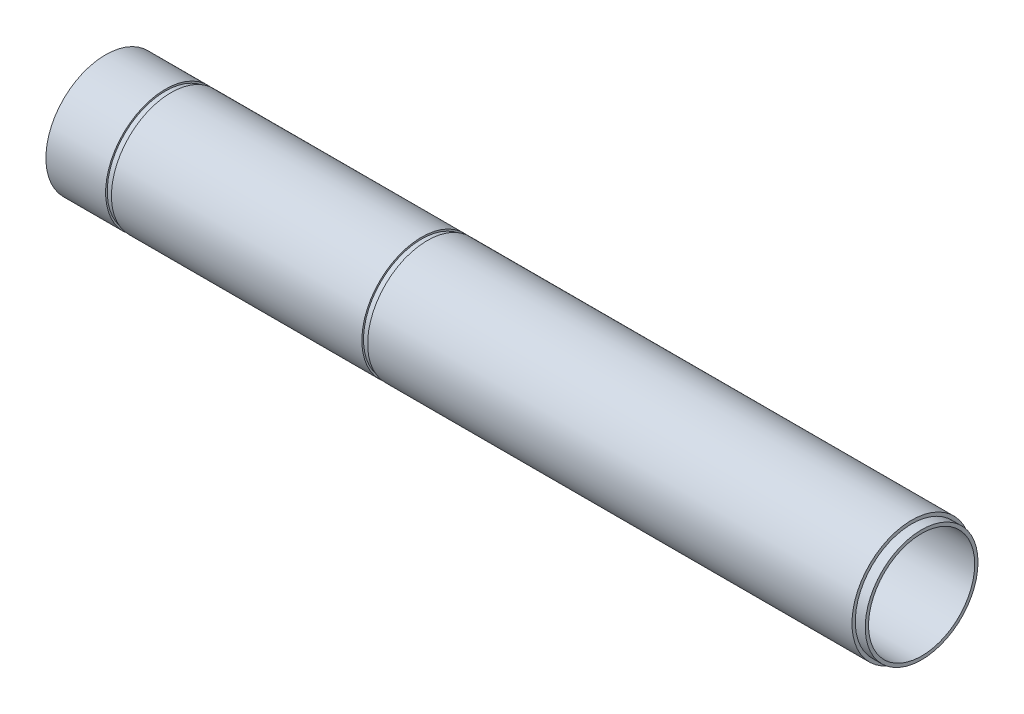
ISO-10303-21;
HEADER;
FILE_DESCRIPTION(('STEP AP214'),'2;1');
FILE_NAME('part.step','',(''),(''),'','','');
FILE_SCHEMA(('AUTOMOTIVE_DESIGN { 1 0 10303 214 1 1 1 1 }'));
ENDSEC;
DATA;
#1=APPLICATION_CONTEXT('core data for automotive mechanical design processes');
#2=APPLICATION_PROTOCOL_DEFINITION('international standard','automotive_design',2000,#1);
#3=PRODUCT_CONTEXT('',#1,'mechanical');
#4=PRODUCT('Part','Part','',(#3));
#5=PRODUCT_RELATED_PRODUCT_CATEGORY('part','',(#4));
#6=PRODUCT_DEFINITION_FORMATION('','',#4);
#7=PRODUCT_DEFINITION_CONTEXT('part definition',#1,'design');
#8=PRODUCT_DEFINITION('design','',#6,#7);
#9=PRODUCT_DEFINITION_SHAPE('','',#8);
#10=(LENGTH_UNIT() NAMED_UNIT(*) SI_UNIT(.MILLI.,.METRE.));
#11=(NAMED_UNIT(*) PLANE_ANGLE_UNIT() SI_UNIT($,.RADIAN.));
#12=(NAMED_UNIT(*) SI_UNIT($,.STERADIAN.) SOLID_ANGLE_UNIT());
#13=UNCERTAINTY_MEASURE_WITH_UNIT(LENGTH_MEASURE(1.E-05),#10,'distance_accuracy_value','');
#14=(GEOMETRIC_REPRESENTATION_CONTEXT(3) GLOBAL_UNCERTAINTY_ASSIGNED_CONTEXT((#13)) GLOBAL_UNIT_ASSIGNED_CONTEXT((#10,
#11,#12)) REPRESENTATION_CONTEXT('',''));
#15=CARTESIAN_POINT('',(0.,0.,0.));
#16=DIRECTION('',(0.,0.,1.));
#17=DIRECTION('',(1.,0.,0.));
#18=AXIS2_PLACEMENT_3D('',#15,#16,#17);
#19=CARTESIAN_POINT('',(48.8143571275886,17.75,0.));
#20=DIRECTION('',(1.,0.,0.));
#21=DIRECTION('',(0.,0.,-1.));
#22=AXIS2_PLACEMENT_3D('',#19,#20,#21);
#23=PLANE('',#22);
#24=CARTESIAN_POINT('',(48.8143571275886,0.,0.));
#25=DIRECTION('',(1.,0.,0.));
#26=DIRECTION('',(0.,0.,-1.));
#27=AXIS2_PLACEMENT_3D('',#24,#25,#26);
#28=CIRCLE('',#27,18.);
#29=CARTESIAN_POINT('',(48.8143571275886,0.,-18.));
#30=VERTEX_POINT('',#29);
#31=EDGE_CURVE('E18',#30,#30,#28,.F.);
#32=ORIENTED_EDGE('',*,*,#31,.F.);
#33=EDGE_LOOP('',(#32));
#34=FACE_BOUND('',#33,.T.);
#35=CARTESIAN_POINT('',(48.8143571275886,0.,0.));
#36=DIRECTION('',(1.,0.,0.));
#37=DIRECTION('',(0.,0.,-1.));
#38=AXIS2_PLACEMENT_3D('',#35,#36,#37);
#39=CIRCLE('',#38,17.5);
#40=CARTESIAN_POINT('',(48.8143571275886,0.,-17.5));
#41=VERTEX_POINT('',#40);
#42=EDGE_CURVE('E58',#41,#41,#39,.T.);
#43=ORIENTED_EDGE('',*,*,#42,.F.);
#44=EDGE_LOOP('',(#43));
#45=FACE_BOUND('',#44,.T.);
#46=ADVANCED_FACE('F14',(#34,#45),#23,.T.);
#47=CARTESIAN_POINT('',(11.0643571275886,0.,0.));
#48=DIRECTION('',(1.,0.,0.));
#49=DIRECTION('',(0.,0.,-1.));
#50=AXIS2_PLACEMENT_3D('',#47,#48,#49);
#51=CYLINDRICAL_SURFACE('',#50,18.);
#52=ORIENTED_EDGE('',*,*,#31,.T.);
#53=EDGE_LOOP('',(#52));
#54=FACE_BOUND('',#53,.T.);
#55=CARTESIAN_POINT('',(-26.6856428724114,0.,0.));
#56=DIRECTION('',(1.,0.,0.));
#57=DIRECTION('',(0.,0.,-1.));
#58=AXIS2_PLACEMENT_3D('',#55,#56,#57);
#59=CIRCLE('',#58,18.);
#60=CARTESIAN_POINT('',(-26.6856428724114,0.,-18.));
#61=VERTEX_POINT('',#60);
#62=EDGE_CURVE('E56',#61,#61,#59,.F.);
#63=ORIENTED_EDGE('',*,*,#62,.F.);
#64=EDGE_LOOP('',(#63));
#65=FACE_BOUND('',#64,.T.);
#66=ADVANCED_FACE('F65',(#54,#65),#51,.T.);
#67=CARTESIAN_POINT('',(49.6893571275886,0.,0.));
#68=DIRECTION('',(1.,0.,0.));
#69=DIRECTION('',(0.,0.,-1.));
#70=AXIS2_PLACEMENT_3D('',#67,#68,#69);
#71=CYLINDRICAL_SURFACE('',#70,17.5);
#72=CARTESIAN_POINT('',(50.5643571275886,0.,0.));
#73=DIRECTION('',(1.,0.,0.));
#74=DIRECTION('',(0.,0.,-1.));
#75=AXIS2_PLACEMENT_3D('',#72,#73,#74);
#76=CIRCLE('',#75,17.5);
#77=CARTESIAN_POINT('',(50.5643571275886,0.,-17.5));
#78=VERTEX_POINT('',#77);
#79=EDGE_CURVE('E53',#78,#78,#76,.T.);
#80=ORIENTED_EDGE('',*,*,#79,.F.);
#81=EDGE_LOOP('',(#80));
#82=FACE_BOUND('',#81,.T.);
#83=ORIENTED_EDGE('',*,*,#42,.T.);
#84=EDGE_LOOP('',(#83));
#85=FACE_BOUND('',#84,.T.);
#86=ADVANCED_FACE('F74',(#82,#85),#71,.T.);
#87=CARTESIAN_POINT('',(-26.6856428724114,17.75,0.));
#88=DIRECTION('',(-1.,0.,0.));
#89=DIRECTION('',(0.,0.,1.));
#90=AXIS2_PLACEMENT_3D('',#87,#88,#89);
#91=PLANE('',#90);
#92=CARTESIAN_POINT('',(-26.6856428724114,0.,0.));
#93=DIRECTION('',(1.,0.,0.));
#94=DIRECTION('',(0.,0.,-1.));
#95=AXIS2_PLACEMENT_3D('',#92,#93,#94);
#96=CIRCLE('',#95,17.5);
#97=CARTESIAN_POINT('',(-26.6856428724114,0.,-17.5));
#98=VERTEX_POINT('',#97);
#99=EDGE_CURVE('E50',#98,#98,#96,.F.);
#100=ORIENTED_EDGE('',*,*,#99,.F.);
#101=EDGE_LOOP('',(#100));
#102=FACE_BOUND('',#101,.T.);
#103=ORIENTED_EDGE('',*,*,#62,.T.);
#104=EDGE_LOOP('',(#103));
#105=FACE_BOUND('',#104,.T.);
#106=ADVANCED_FACE('F119',(#102,#105),#91,.T.);
#107=CARTESIAN_POINT('',(50.5643571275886,17.75,0.));
#108=DIRECTION('',(-1.,0.,0.));
#109=DIRECTION('',(0.,0.,1.));
#110=AXIS2_PLACEMENT_3D('',#107,#108,#109);
#111=PLANE('',#110);
#112=ORIENTED_EDGE('',*,*,#79,.T.);
#113=EDGE_LOOP('',(#112));
#114=FACE_BOUND('',#113,.T.);
#115=CARTESIAN_POINT('',(50.5643571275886,0.,0.));
#116=DIRECTION('',(1.,0.,0.));
#117=DIRECTION('',(0.,0.,-1.));
#118=AXIS2_PLACEMENT_3D('',#115,#116,#117);
#119=CIRCLE('',#118,18.);
#120=CARTESIAN_POINT('',(50.5643571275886,0.,-18.));
#121=VERTEX_POINT('',#120);
#122=EDGE_CURVE('E47',#121,#121,#119,.T.);
#123=ORIENTED_EDGE('',*,*,#122,.F.);
#124=EDGE_LOOP('',(#123));
#125=FACE_BOUND('',#124,.T.);
#126=ADVANCED_FACE('F115',(#114,#125),#111,.T.);
#127=CARTESIAN_POINT('',(-27.5606428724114,0.,0.));
#128=DIRECTION('',(1.,0.,0.));
#129=DIRECTION('',(0.,0.,-1.));
#130=AXIS2_PLACEMENT_3D('',#127,#128,#129);
#131=CYLINDRICAL_SURFACE('',#130,17.5);
#132=ORIENTED_EDGE('',*,*,#99,.T.);
#133=EDGE_LOOP('',(#132));
#134=FACE_BOUND('',#133,.T.);
#135=CARTESIAN_POINT('',(-28.4356428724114,0.,0.));
#136=DIRECTION('',(1.,0.,0.));
#137=DIRECTION('',(0.,0.,-1.));
#138=AXIS2_PLACEMENT_3D('',#135,#136,#137);
#139=CIRCLE('',#138,17.5);
#140=CARTESIAN_POINT('',(-28.4356428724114,0.,-17.5));
#141=VERTEX_POINT('',#140);
#142=EDGE_CURVE('E44',#141,#141,#139,.F.);
#143=ORIENTED_EDGE('',*,*,#142,.F.);
#144=EDGE_LOOP('',(#143));
#145=FACE_BOUND('',#144,.T.);
#146=ADVANCED_FACE('F111',(#134,#145),#131,.T.);
#147=CARTESIAN_POINT('',(123.564357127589,0.,0.));
#148=DIRECTION('',(1.,0.,0.));
#149=DIRECTION('',(0.,0.,-1.));
#150=AXIS2_PLACEMENT_3D('',#147,#148,#149);
#151=CYLINDRICAL_SURFACE('',#150,18.);
#152=CARTESIAN_POINT('',(196.564357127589,0.,0.));
#153=DIRECTION('',(1.,0.,0.));
#154=DIRECTION('',(0.,0.,-1.));
#155=AXIS2_PLACEMENT_3D('',#152,#153,#154);
#156=CIRCLE('',#155,18.);
#157=CARTESIAN_POINT('',(196.564357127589,0.,-18.));
#158=VERTEX_POINT('',#157);
#159=EDGE_CURVE('E41',#158,#158,#156,.T.);
#160=ORIENTED_EDGE('',*,*,#159,.F.);
#161=EDGE_LOOP('',(#160));
#162=FACE_BOUND('',#161,.T.);
#163=ORIENTED_EDGE('',*,*,#122,.T.);
#164=EDGE_LOOP('',(#163));
#165=FACE_BOUND('',#164,.T.);
#166=ADVANCED_FACE('F107',(#162,#165),#151,.T.);
#167=CARTESIAN_POINT('',(-28.4356428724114,17.75,0.));
#168=DIRECTION('',(1.,0.,0.));
#169=DIRECTION('',(0.,0.,-1.));
#170=AXIS2_PLACEMENT_3D('',#167,#168,#169);
#171=PLANE('',#170);
#172=CARTESIAN_POINT('',(-28.4356428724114,0.,0.));
#173=DIRECTION('',(1.,0.,0.));
#174=DIRECTION('',(0.,0.,-1.));
#175=AXIS2_PLACEMENT_3D('',#172,#173,#174);
#176=CIRCLE('',#175,18.);
#177=CARTESIAN_POINT('',(-28.4356428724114,0.,-18.));
#178=VERTEX_POINT('',#177);
#179=EDGE_CURVE('E38',#178,#178,#176,.F.);
#180=ORIENTED_EDGE('',*,*,#179,.F.);
#181=EDGE_LOOP('',(#180));
#182=FACE_BOUND('',#181,.T.);
#183=ORIENTED_EDGE('',*,*,#142,.T.);
#184=EDGE_LOOP('',(#183));
#185=FACE_BOUND('',#184,.T.);
#186=ADVANCED_FACE('F101',(#182,#185),#171,.T.);
#187=CARTESIAN_POINT('',(196.564357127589,17.5,0.));
#188=DIRECTION('',(1.,0.,0.));
#189=DIRECTION('',(0.,0.,-1.));
#190=AXIS2_PLACEMENT_3D('',#187,#188,#189);
#191=PLANE('',#190);
#192=ORIENTED_EDGE('',*,*,#159,.T.);
#193=EDGE_LOOP('',(#192));
#194=FACE_BOUND('',#193,.T.);
#195=CARTESIAN_POINT('',(196.564357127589,0.,0.));
#196=DIRECTION('',(1.,0.,0.));
#197=DIRECTION('',(0.,0.,-1.));
#198=AXIS2_PLACEMENT_3D('',#195,#196,#197);
#199=CIRCLE('',#198,17.);
#200=CARTESIAN_POINT('',(196.564357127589,0.,-17.));
#201=VERTEX_POINT('',#200);
#202=EDGE_CURVE('E35',#201,#201,#199,.T.);
#203=ORIENTED_EDGE('',*,*,#202,.F.);
#204=EDGE_LOOP('',(#203));
#205=FACE_BOUND('',#204,.T.);
#206=ADVANCED_FACE('F93',(#194,#205),#191,.T.);
#207=CARTESIAN_POINT('',(-37.4356428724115,0.,0.));
#208=DIRECTION('',(1.,0.,0.));
#209=DIRECTION('',(0.,0.,-1.));
#210=AXIS2_PLACEMENT_3D('',#207,#208,#209);
#211=CYLINDRICAL_SURFACE('',#210,18.);
#212=ORIENTED_EDGE('',*,*,#179,.T.);
#213=EDGE_LOOP('',(#212));
#214=FACE_BOUND('',#213,.T.);
#215=CARTESIAN_POINT('',(-46.4356428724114,0.,0.));
#216=DIRECTION('',(1.,0.,0.));
#217=DIRECTION('',(0.,0.,-1.));
#218=AXIS2_PLACEMENT_3D('',#215,#216,#217);
#219=CIRCLE('',#218,18.);
#220=CARTESIAN_POINT('',(-46.4356428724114,0.,-18.));
#221=VERTEX_POINT('',#220);
#222=EDGE_CURVE('E32',#221,#221,#219,.F.);
#223=ORIENTED_EDGE('',*,*,#222,.F.);
#224=EDGE_LOOP('',(#223));
#225=FACE_BOUND('',#224,.T.);
#226=ADVANCED_FACE('F91',(#214,#225),#211,.T.);
#227=CARTESIAN_POINT('',(198.064357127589,0.,0.));
#228=DIRECTION('',(1.,0.,0.));
#229=DIRECTION('',(0.,0.,-1.));
#230=AXIS2_PLACEMENT_3D('',#227,#228,#229);
#231=CYLINDRICAL_SURFACE('',#230,17.);
#232=CARTESIAN_POINT('',(199.564357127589,0.,0.));
#233=DIRECTION('',(1.,0.,0.));
#234=DIRECTION('',(0.,0.,-1.));
#235=AXIS2_PLACEMENT_3D('',#232,#233,#234);
#236=CIRCLE('',#235,17.);
#237=CARTESIAN_POINT('',(199.564357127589,0.,-17.));
#238=VERTEX_POINT('',#237);
#239=EDGE_CURVE('E27',#238,#238,#236,.T.);
#240=ORIENTED_EDGE('',*,*,#239,.F.);
#241=EDGE_LOOP('',(#240));
#242=FACE_BOUND('',#241,.T.);
#243=ORIENTED_EDGE('',*,*,#202,.T.);
#244=EDGE_LOOP('',(#243));
#245=FACE_BOUND('',#244,.T.);
#246=ADVANCED_FACE('F87',(#242,#245),#231,.T.);
#247=CARTESIAN_POINT('',(-46.4356428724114,17.,0.));
#248=DIRECTION('',(-1.,0.,0.));
#249=DIRECTION('',(0.,0.,1.));
#250=AXIS2_PLACEMENT_3D('',#247,#248,#249);
#251=PLANE('',#250);
#252=CARTESIAN_POINT('',(-46.4356428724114,0.,0.));
#253=DIRECTION('',(1.,0.,0.));
#254=DIRECTION('',(0.,0.,-1.));
#255=AXIS2_PLACEMENT_3D('',#252,#253,#254);
#256=CIRCLE('',#255,16.);
#257=CARTESIAN_POINT('',(-46.4356428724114,0.,-16.));
#258=VERTEX_POINT('',#257);
#259=EDGE_CURVE('E22',#258,#258,#256,.F.);
#260=ORIENTED_EDGE('',*,*,#259,.F.);
#261=EDGE_LOOP('',(#260));
#262=FACE_BOUND('',#261,.T.);
#263=ORIENTED_EDGE('',*,*,#222,.T.);
#264=EDGE_LOOP('',(#263));
#265=FACE_BOUND('',#264,.T.);
#266=ADVANCED_FACE('F81',(#262,#265),#251,.T.);
#267=CARTESIAN_POINT('',(199.564357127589,16.5,0.));
#268=DIRECTION('',(1.,0.,0.));
#269=DIRECTION('',(0.,0.,-1.));
#270=AXIS2_PLACEMENT_3D('',#267,#268,#269);
#271=PLANE('',#270);
#272=ORIENTED_EDGE('',*,*,#239,.T.);
#273=EDGE_LOOP('',(#272));
#274=FACE_BOUND('',#273,.T.);
#275=CARTESIAN_POINT('',(199.564357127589,0.,0.));
#276=DIRECTION('',(1.,0.,0.));
#277=DIRECTION('',(0.,0.,-1.));
#278=AXIS2_PLACEMENT_3D('',#275,#276,#277);
#279=CIRCLE('',#278,16.);
#280=CARTESIAN_POINT('',(199.564357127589,0.,-16.));
#281=VERTEX_POINT('',#280);
#282=EDGE_CURVE('E9',#281,#281,#279,.T.);
#283=ORIENTED_EDGE('',*,*,#282,.F.);
#284=EDGE_LOOP('',(#283));
#285=FACE_BOUND('',#284,.T.);
#286=ADVANCED_FACE('F77',(#274,#285),#271,.T.);
#287=CARTESIAN_POINT('',(-46.4356428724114,0.,0.));
#288=DIRECTION('',(1.,0.,0.));
#289=DIRECTION('',(0.,0.,-1.));
#290=AXIS2_PLACEMENT_3D('',#287,#288,#289);
#291=CYLINDRICAL_SURFACE('',#290,16.);
#292=ORIENTED_EDGE('',*,*,#259,.T.);
#293=EDGE_LOOP('',(#292));
#294=FACE_BOUND('',#293,.T.);
#295=ORIENTED_EDGE('',*,*,#282,.T.);
#296=EDGE_LOOP('',(#295));
#297=FACE_BOUND('',#296,.T.);
#298=ADVANCED_FACE('F16',(#294,#297),#291,.F.);
#299=CLOSED_SHELL('',(#46,#66,#86,#106,#126,#146,#166,#186,#206,#226,#246,#266,#286,#298));
#300=MANIFOLD_SOLID_BREP('B1',#299);
#301=ADVANCED_BREP_SHAPE_REPRESENTATION('',(#18,#300),#14);
#302=SHAPE_DEFINITION_REPRESENTATION(#9,#301);
ENDSEC;
END-ISO-10303-21;
